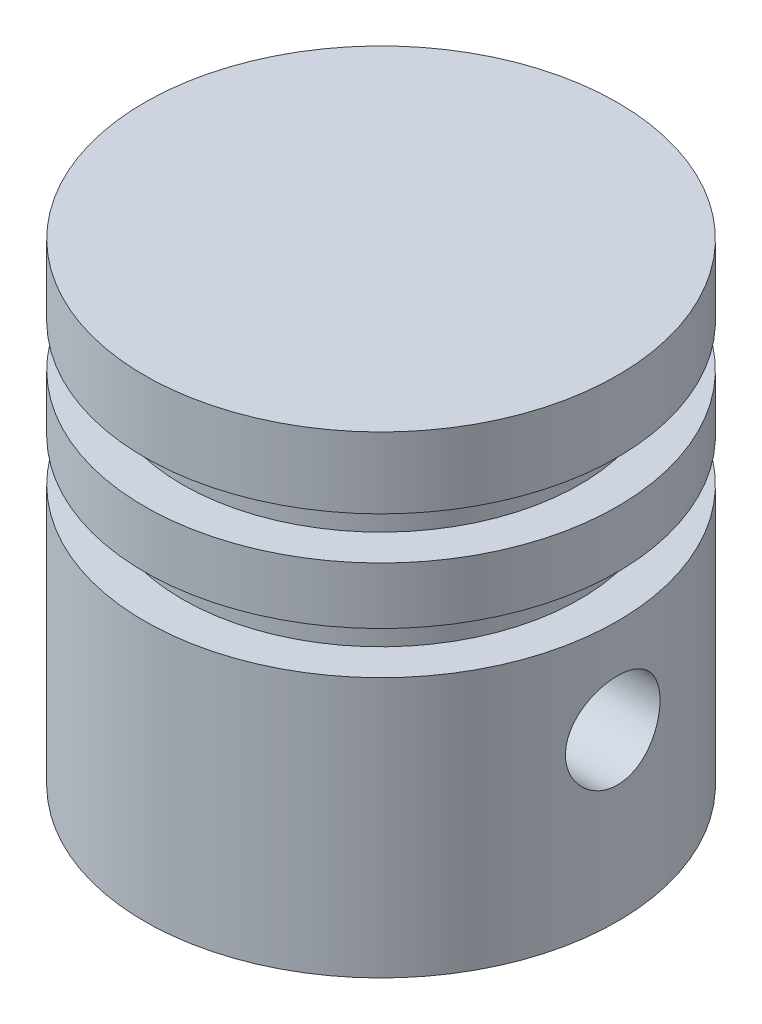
from build123d import *

# Parameters (mm, degrees)
DODANIE_WYCI_GNI_CIE1_REACH                  = 124.474
DODANIE_WYCI_GNI_CIE1_END_RADIUS             = 29.728920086
SZKIC2_R                                     = 15
SZKIC2_R_2                                   = 10
DODANIE_WYCI_GNI_CIE1_DIRECTION_2_REACH      = 124.474
DODANIE_WYCI_GNI_CIE1_DIRECTION_2_END_RADIUS = 29.728920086
WYTNIJ_WYCI_GNI_CIE1_DEPTH                   = 123.474487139
WYTNIJ_WYCI_GNI_CIE1_DEPTH_BACK              = 123.474487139
SZKIC3_R                                     = 10
SZKIC4_R                                     = 15
WYTNIJ_WYCI_GNI_CIE2_DEPTH                   = 10


with BuildPart() as part:
    # Szkic1 → Obr_t1 (revolve)
    with BuildSketch(Plane.XY, mode=Mode.PRIVATE) as obr_t1_sk:
        Polygon((0, 100), (50, 100), (50, 85), (42, 85), (42, 76), (50, 76), (50, 64), (42, 64), (42, 55), (50, 55), (50, 0), (29.728920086, 0), (29.728920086, 60), (12.408412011, 90), (0, 90), align=None)
    revolve(obr_t1_sk.sketch.rotate(Axis((0, 0, 0), (0, 1, 0)), 90), axis=Axis((0, 0, 0), (0, 1, 0)))

    # Dodanie-wyci_gni_cie1: up to this cylinder (the profile starts inside it)
    dodanie_wyci_gni_cie1_end = Plane(origin=(0, 35, 0), z_dir=(0, -1, 0)) * Cylinder(DODANIE_WYCI_GNI_CIE1_END_RADIUS, 309.405840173, mode=Mode.PRIVATE)
    # Szkic2 → Dodanie-wyci_gni_cie1 (add, up to the surface)
    with BuildSketch(Plane(origin=(0, 0, 0), x_dir=(0, 0, -1), z_dir=(1, 0, 0)), mode=Mode.PRIVATE) as dodanie_wyci_gni_cie1_sk1:
        with Locations((0, 35)):
            Circle(SZKIC2_R)
        with Locations((0, 35)):
            Circle(SZKIC2_R_2, mode=Mode.SUBTRACT)
    dodanie_wyci_gni_cie1_tool1 = extrude(dodanie_wyci_gni_cie1_sk1.sketch, amount=DODANIE_WYCI_GNI_CIE1_REACH, mode=Mode.PRIVATE) & dodanie_wyci_gni_cie1_end
    add(dodanie_wyci_gni_cie1_tool1.solids().sort_by_distance((0, 35, 14.575736))[0])

    # Dodanie-wyci_gni_cie1 direction 2: up to this cylinder (the profile starts inside it)
    dodanie_wyci_gni_cie1_direction_2_end = Plane(origin=(0, 35, 0), z_dir=(0, -1, 0)) * Cylinder(DODANIE_WYCI_GNI_CIE1_DIRECTION_2_END_RADIUS, 309.405840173, mode=Mode.PRIVATE)
    # Szkic2 → Dodanie-wyci_gni_cie1 direction 2 (add, up to the surface)
    with BuildSketch(Plane(origin=(0, 0, 0), x_dir=(0, 0, -1), z_dir=(1, 0, 0)), mode=Mode.PRIVATE) as dodanie_wyci_gni_cie1_direction_2_sk1:
        with Locations((0, 35)):
            Circle(SZKIC2_R)
        with Locations((0, 35)):
            Circle(SZKIC2_R_2, mode=Mode.SUBTRACT)
    dodanie_wyci_gni_cie1_direction_2_tool1 = extrude(dodanie_wyci_gni_cie1_direction_2_sk1.sketch, amount=-DODANIE_WYCI_GNI_CIE1_DIRECTION_2_REACH, mode=Mode.PRIVATE) & dodanie_wyci_gni_cie1_direction_2_end
    add(dodanie_wyci_gni_cie1_direction_2_tool1.solids().sort_by_distance((0, 35, 14.575736))[0])

    # Szkic3 → Wytnij-wyci_gni_cie1 (cut, two sides: drawn at the far end of the back side and taken through both)
    with BuildSketch(Plane(origin=(0, 0, 0), x_dir=(0, 0, -1), z_dir=(1, 0, 0)).offset(-WYTNIJ_WYCI_GNI_CIE1_DEPTH_BACK)):
        with Locations((0, 35)):
            Circle(SZKIC3_R)
    extrude(amount=WYTNIJ_WYCI_GNI_CIE1_DEPTH + WYTNIJ_WYCI_GNI_CIE1_DEPTH_BACK, mode=Mode.SUBTRACT)

    # Szkic4 → Wytnij-wyci_gni_cie2 (cut, symmetric)
    with BuildSketch(Plane(origin=(0, 0, 0), x_dir=(0, 0, -1), z_dir=(1, 0, 0))):
        with Locations((0, 35)):
            Circle(SZKIC4_R)
    extrude(amount=WYTNIJ_WYCI_GNI_CIE2_DEPTH, both=True, mode=Mode.SUBTRACT)


solid = part.part
